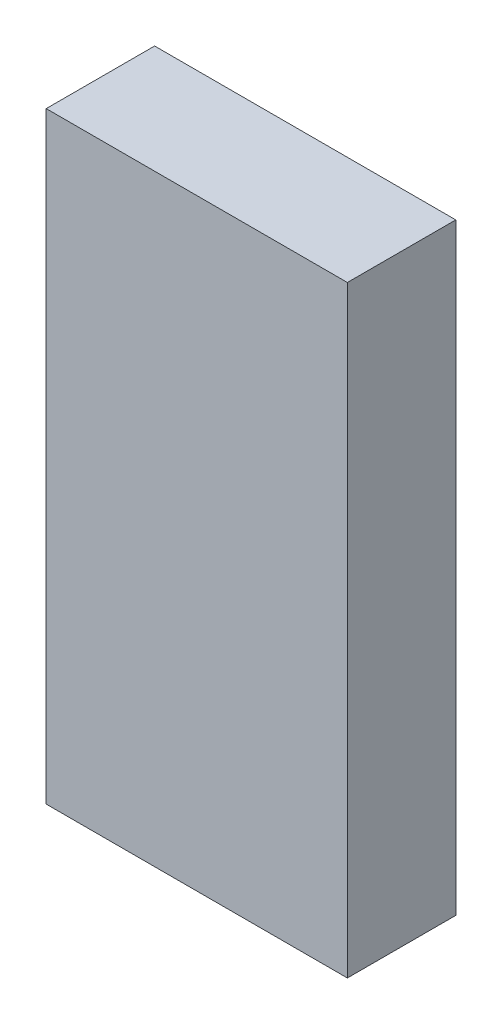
ISO-10303-21;
HEADER;
FILE_DESCRIPTION(('STEP AP214'),'2;1');
FILE_NAME('part.step','',(''),(''),'','','');
FILE_SCHEMA(('AUTOMOTIVE_DESIGN { 1 0 10303 214 1 1 1 1 }'));
ENDSEC;
DATA;
#1=APPLICATION_CONTEXT('core data for automotive mechanical design processes');
#2=APPLICATION_PROTOCOL_DEFINITION('international standard','automotive_design',2000,#1);
#3=PRODUCT_CONTEXT('',#1,'mechanical');
#4=PRODUCT('Part','Part','',(#3));
#5=PRODUCT_RELATED_PRODUCT_CATEGORY('part','',(#4));
#6=PRODUCT_DEFINITION_FORMATION('','',#4);
#7=PRODUCT_DEFINITION_CONTEXT('part definition',#1,'design');
#8=PRODUCT_DEFINITION('design','',#6,#7);
#9=PRODUCT_DEFINITION_SHAPE('','',#8);
#10=(LENGTH_UNIT() NAMED_UNIT(*) SI_UNIT(.MILLI.,.METRE.));
#11=(NAMED_UNIT(*) PLANE_ANGLE_UNIT() SI_UNIT($,.RADIAN.));
#12=(NAMED_UNIT(*) SI_UNIT($,.STERADIAN.) SOLID_ANGLE_UNIT());
#13=UNCERTAINTY_MEASURE_WITH_UNIT(LENGTH_MEASURE(1.E-05),#10,'distance_accuracy_value','');
#14=(GEOMETRIC_REPRESENTATION_CONTEXT(3) GLOBAL_UNCERTAINTY_ASSIGNED_CONTEXT((#13)) GLOBAL_UNIT_ASSIGNED_CONTEXT((#10,
#11,#12)) REPRESENTATION_CONTEXT('',''));
#15=CARTESIAN_POINT('',(0.,0.,0.));
#16=DIRECTION('',(0.,0.,1.));
#17=DIRECTION('',(1.,0.,0.));
#18=AXIS2_PLACEMENT_3D('',#15,#16,#17);
#19=CARTESIAN_POINT('',(50.,100.,36.));
#20=DIRECTION('',(-1.,0.,0.));
#21=DIRECTION('',(0.,-1.,0.));
#22=AXIS2_PLACEMENT_3D('',#19,#20,#21);
#23=PLANE('',#22);
#24=DIRECTION('',(0.,1.,0.));
#25=VECTOR('',#24,1.);
#26=CARTESIAN_POINT('',(50.,100.,0.));
#27=LINE('',#26,#25);
#28=CARTESIAN_POINT('',(50.,-100.,0.));
#29=VERTEX_POINT('',#28);
#30=CARTESIAN_POINT('',(50.,100.,0.));
#31=VERTEX_POINT('',#30);
#32=EDGE_CURVE('E250',#29,#31,#27,.T.);
#33=ORIENTED_EDGE('',*,*,#32,.T.);
#34=DIRECTION('',(0.,0.,-1.));
#35=VECTOR('',#34,1.);
#36=CARTESIAN_POINT('',(50.,100.,36.));
#37=LINE('',#36,#35);
#38=CARTESIAN_POINT('',(50.,100.,36.));
#39=VERTEX_POINT('',#38);
#40=EDGE_CURVE('E274',#39,#31,#37,.T.);
#41=ORIENTED_EDGE('',*,*,#40,.F.);
#42=DIRECTION('',(0.,1.,0.));
#43=VECTOR('',#42,1.);
#44=CARTESIAN_POINT('',(50.,100.,36.));
#45=LINE('',#44,#43);
#46=CARTESIAN_POINT('',(50.,-100.,36.));
#47=VERTEX_POINT('',#46);
#48=EDGE_CURVE('E235',#47,#39,#45,.T.);
#49=ORIENTED_EDGE('',*,*,#48,.F.);
#50=DIRECTION('',(0.,0.,-1.));
#51=VECTOR('',#50,1.);
#52=CARTESIAN_POINT('',(50.,-100.,36.));
#53=LINE('',#52,#51);
#54=EDGE_CURVE('E249',#47,#29,#53,.T.);
#55=ORIENTED_EDGE('',*,*,#54,.T.);
#56=EDGE_LOOP('',(#33,#41,#49,#55));
#57=FACE_BOUND('',#56,.T.);
#58=ADVANCED_FACE('F39',(#57),#23,.F.);
#59=CARTESIAN_POINT('',(-50.,100.,36.));
#60=DIRECTION('',(0.,-1.,0.));
#61=DIRECTION('',(0.,0.,-1.));
#62=AXIS2_PLACEMENT_3D('',#59,#60,#61);
#63=PLANE('',#62);
#64=DIRECTION('',(-1.,0.,0.));
#65=VECTOR('',#64,1.);
#66=CARTESIAN_POINT('',(-50.,100.,0.));
#67=LINE('',#66,#65);
#68=CARTESIAN_POINT('',(-50.,100.,0.));
#69=VERTEX_POINT('',#68);
#70=EDGE_CURVE('E254',#31,#69,#67,.T.);
#71=ORIENTED_EDGE('',*,*,#70,.T.);
#72=DIRECTION('',(0.,0.,-1.));
#73=VECTOR('',#72,1.);
#74=CARTESIAN_POINT('',(-50.,100.,36.));
#75=LINE('',#74,#73);
#76=CARTESIAN_POINT('',(-50.,100.,36.));
#77=VERTEX_POINT('',#76);
#78=EDGE_CURVE('E270',#77,#69,#75,.T.);
#79=ORIENTED_EDGE('',*,*,#78,.F.);
#80=DIRECTION('',(-1.,0.,0.));
#81=VECTOR('',#80,1.);
#82=CARTESIAN_POINT('',(-50.,100.,36.));
#83=LINE('',#82,#81);
#84=EDGE_CURVE('E239',#39,#77,#83,.T.);
#85=ORIENTED_EDGE('',*,*,#84,.F.);
#86=ORIENTED_EDGE('',*,*,#40,.T.);
#87=EDGE_LOOP('',(#71,#79,#85,#86));
#88=FACE_BOUND('',#87,.T.);
#89=ADVANCED_FACE('F444',(#88),#63,.F.);
#90=CARTESIAN_POINT('',(-50.,100.,36.));
#91=DIRECTION('',(1.,0.,0.));
#92=DIRECTION('',(0.,1.,0.));
#93=AXIS2_PLACEMENT_3D('',#90,#91,#92);
#94=PLANE('',#93);
#95=DIRECTION('',(0.,-1.,0.));
#96=VECTOR('',#95,1.);
#97=CARTESIAN_POINT('',(-50.,100.,0.));
#98=LINE('',#97,#96);
#99=CARTESIAN_POINT('',(-50.,-100.,0.));
#100=VERTEX_POINT('',#99);
#101=EDGE_CURVE('E258',#69,#100,#98,.T.);
#102=ORIENTED_EDGE('',*,*,#101,.T.);
#103=DIRECTION('',(0.,0.,-1.));
#104=VECTOR('',#103,1.);
#105=CARTESIAN_POINT('',(-50.,-100.,36.));
#106=LINE('',#105,#104);
#107=CARTESIAN_POINT('',(-50.,-100.,36.));
#108=VERTEX_POINT('',#107);
#109=EDGE_CURVE('E266',#108,#100,#106,.T.);
#110=ORIENTED_EDGE('',*,*,#109,.F.);
#111=DIRECTION('',(0.,-1.,0.));
#112=VECTOR('',#111,1.);
#113=CARTESIAN_POINT('',(-50.,100.,36.));
#114=LINE('',#113,#112);
#115=EDGE_CURVE('E243',#77,#108,#114,.T.);
#116=ORIENTED_EDGE('',*,*,#115,.F.);
#117=ORIENTED_EDGE('',*,*,#78,.T.);
#118=EDGE_LOOP('',(#102,#110,#116,#117));
#119=FACE_BOUND('',#118,.T.);
#120=ADVANCED_FACE('F450',(#119),#94,.F.);
#121=CARTESIAN_POINT('',(-50.,-100.,36.));
#122=DIRECTION('',(0.,1.,0.));
#123=DIRECTION('',(0.,0.,1.));
#124=AXIS2_PLACEMENT_3D('',#121,#122,#123);
#125=PLANE('',#124);
#126=DIRECTION('',(1.,0.,0.));
#127=VECTOR('',#126,1.);
#128=CARTESIAN_POINT('',(-50.,-100.,0.));
#129=LINE('',#128,#127);
#130=EDGE_CURVE('E240',#100,#29,#129,.T.);
#131=ORIENTED_EDGE('',*,*,#130,.T.);
#132=ORIENTED_EDGE('',*,*,#54,.F.);
#133=DIRECTION('',(1.,0.,0.));
#134=VECTOR('',#133,1.);
#135=CARTESIAN_POINT('',(-50.,-100.,36.));
#136=LINE('',#135,#134);
#137=EDGE_CURVE('E246',#108,#47,#136,.T.);
#138=ORIENTED_EDGE('',*,*,#137,.F.);
#139=ORIENTED_EDGE('',*,*,#109,.T.);
#140=EDGE_LOOP('',(#131,#132,#138,#139));
#141=FACE_BOUND('',#140,.T.);
#142=ADVANCED_FACE('F603',(#141),#125,.F.);
#143=CARTESIAN_POINT('',(0.,0.,36.));
#144=DIRECTION('',(0.,0.,1.));
#145=DIRECTION('',(1.,0.,0.));
#146=AXIS2_PLACEMENT_3D('',#143,#144,#145);
#147=PLANE('',#146);
#148=ORIENTED_EDGE('',*,*,#48,.T.);
#149=ORIENTED_EDGE('',*,*,#84,.T.);
#150=ORIENTED_EDGE('',*,*,#115,.T.);
#151=ORIENTED_EDGE('',*,*,#137,.T.);
#152=EDGE_LOOP('',(#148,#149,#150,#151));
#153=FACE_BOUND('',#152,.T.);
#154=ADVANCED_FACE('F600',(#153),#147,.T.);
#155=CARTESIAN_POINT('',(0.,0.,0.));
#156=DIRECTION('',(0.,0.,1.));
#157=DIRECTION('',(1.,0.,0.));
#158=AXIS2_PLACEMENT_3D('',#155,#156,#157);
#159=PLANE('',#158);
#160=DIRECTION('',(1.,0.,0.));
#161=VECTOR('',#160,1.);
#162=CARTESIAN_POINT('',(45.,95.,0.));
#163=LINE('',#162,#161);
#164=CARTESIAN_POINT('',(-45.,95.,0.));
#165=VERTEX_POINT('',#164);
#166=CARTESIAN_POINT('',(45.,95.,0.));
#167=VERTEX_POINT('',#166);
#168=EDGE_CURVE('E200',#165,#167,#163,.T.);
#169=ORIENTED_EDGE('',*,*,#168,.F.);
#170=DIRECTION('',(0.,1.,0.));
#171=VECTOR('',#170,1.);
#172=CARTESIAN_POINT('',(-45.,95.,0.));
#173=LINE('',#172,#171);
#174=CARTESIAN_POINT('',(-45.,-95.,0.));
#175=VERTEX_POINT('',#174);
#176=EDGE_CURVE('E55',#175,#165,#173,.T.);
#177=ORIENTED_EDGE('',*,*,#176,.F.);
#178=DIRECTION('',(-1.,0.,0.));
#179=VECTOR('',#178,1.);
#180=CARTESIAN_POINT('',(45.,-95.,0.));
#181=LINE('',#180,#179);
#182=CARTESIAN_POINT('',(45.,-95.,0.));
#183=VERTEX_POINT('',#182);
#184=EDGE_CURVE('E187',#183,#175,#181,.T.);
#185=ORIENTED_EDGE('',*,*,#184,.F.);
#186=DIRECTION('',(0.,-1.,0.));
#187=VECTOR('',#186,1.);
#188=CARTESIAN_POINT('',(45.,95.,0.));
#189=LINE('',#188,#187);
#190=EDGE_CURVE('E191',#167,#183,#189,.T.);
#191=ORIENTED_EDGE('',*,*,#190,.F.);
#192=EDGE_LOOP('',(#169,#177,#185,#191));
#193=FACE_BOUND('',#192,.T.);
#194=ORIENTED_EDGE('',*,*,#32,.F.);
#195=ORIENTED_EDGE('',*,*,#130,.F.);
#196=ORIENTED_EDGE('',*,*,#101,.F.);
#197=ORIENTED_EDGE('',*,*,#70,.F.);
#198=EDGE_LOOP('',(#194,#195,#196,#197));
#199=FACE_BOUND('',#198,.T.);
#200=ADVANCED_FACE('F566',(#193,#199),#159,.F.);
#201=CARTESIAN_POINT('',(0.,0.,5.));
#202=DIRECTION('',(0.,0.,-1.));
#203=DIRECTION('',(-1.,0.,0.));
#204=AXIS2_PLACEMENT_3D('',#201,#202,#203);
#205=PLANE('',#204);
#206=DIRECTION('',(0.,1.,0.));
#207=VECTOR('',#206,1.);
#208=CARTESIAN_POINT('',(-45.,95.,5.));
#209=LINE('',#208,#207);
#210=CARTESIAN_POINT('',(-45.,-95.,5.));
#211=VERTEX_POINT('',#210);
#212=CARTESIAN_POINT('',(-45.,95.,5.));
#213=VERTEX_POINT('',#212);
#214=EDGE_CURVE('E166',#211,#213,#209,.T.);
#215=ORIENTED_EDGE('',*,*,#214,.T.);
#216=DIRECTION('',(1.,0.,0.));
#217=VECTOR('',#216,1.);
#218=CARTESIAN_POINT('',(45.,95.,5.));
#219=LINE('',#218,#217);
#220=CARTESIAN_POINT('',(45.,95.,5.));
#221=VERTEX_POINT('',#220);
#222=EDGE_CURVE('E176',#213,#221,#219,.T.);
#223=ORIENTED_EDGE('',*,*,#222,.T.);
#224=DIRECTION('',(0.,-1.,0.));
#225=VECTOR('',#224,1.);
#226=CARTESIAN_POINT('',(45.,95.,5.));
#227=LINE('',#226,#225);
#228=CARTESIAN_POINT('',(45.,-95.,5.));
#229=VERTEX_POINT('',#228);
#230=EDGE_CURVE('E182',#221,#229,#227,.T.);
#231=ORIENTED_EDGE('',*,*,#230,.T.);
#232=DIRECTION('',(-1.,0.,0.));
#233=VECTOR('',#232,1.);
#234=CARTESIAN_POINT('',(45.,-95.,5.));
#235=LINE('',#234,#233);
#236=EDGE_CURVE('E173',#229,#211,#235,.T.);
#237=ORIENTED_EDGE('',*,*,#236,.T.);
#238=EDGE_LOOP('',(#215,#223,#231,#237));
#239=FACE_BOUND('',#238,.T.);
#240=CARTESIAN_POINT('',(25.,75.,5.));
#241=DIRECTION('',(0.,0.,-1.));
#242=DIRECTION('',(-1.,0.,0.));
#243=AXIS2_PLACEMENT_3D('',#240,#241,#242);
#244=CIRCLE('',#243,10.);
#245=CARTESIAN_POINT('',(35.,75.,5.));
#246=VERTEX_POINT('',#245);
#247=CARTESIAN_POINT('',(25.,85.,5.));
#248=VERTEX_POINT('',#247);
#249=EDGE_CURVE('E231',#246,#248,#244,.F.);
#250=ORIENTED_EDGE('',*,*,#249,.T.);
#251=DIRECTION('',(-1.,0.,0.));
#252=VECTOR('',#251,1.);
#253=CARTESIAN_POINT('',(35.,85.,5.));
#254=LINE('',#253,#252);
#255=CARTESIAN_POINT('',(-25.,85.,5.));
#256=VERTEX_POINT('',#255);
#257=EDGE_CURVE('E225',#248,#256,#254,.T.);
#258=ORIENTED_EDGE('',*,*,#257,.T.);
#259=CARTESIAN_POINT('',(-25.,75.,5.));
#260=DIRECTION('',(0.,0.,-1.));
#261=DIRECTION('',(-1.,0.,0.));
#262=AXIS2_PLACEMENT_3D('',#259,#260,#261);
#263=CIRCLE('',#262,10.);
#264=CARTESIAN_POINT('',(-35.,75.,5.));
#265=VERTEX_POINT('',#264);
#266=EDGE_CURVE('E222',#256,#265,#263,.F.);
#267=ORIENTED_EDGE('',*,*,#266,.T.);
#268=DIRECTION('',(0.,-1.,0.));
#269=VECTOR('',#268,1.);
#270=CARTESIAN_POINT('',(-35.,85.,5.));
#271=LINE('',#270,#269);
#272=CARTESIAN_POINT('',(-35.,-75.,5.));
#273=VERTEX_POINT('',#272);
#274=EDGE_CURVE('E62',#265,#273,#271,.T.);
#275=ORIENTED_EDGE('',*,*,#274,.T.);
#276=CARTESIAN_POINT('',(-25.,-75.,5.));
#277=DIRECTION('',(0.,0.,-1.));
#278=DIRECTION('',(-1.,0.,0.));
#279=AXIS2_PLACEMENT_3D('',#276,#277,#278);
#280=CIRCLE('',#279,10.);
#281=CARTESIAN_POINT('',(-25.,-85.,5.));
#282=VERTEX_POINT('',#281);
#283=EDGE_CURVE('E11',#273,#282,#280,.F.);
#284=ORIENTED_EDGE('',*,*,#283,.T.);
#285=DIRECTION('',(1.,0.,0.));
#286=VECTOR('',#285,1.);
#287=CARTESIAN_POINT('',(35.,-85.,5.));
#288=LINE('',#287,#286);
#289=CARTESIAN_POINT('',(25.,-85.,5.));
#290=VERTEX_POINT('',#289);
#291=EDGE_CURVE('E209',#282,#290,#288,.T.);
#292=ORIENTED_EDGE('',*,*,#291,.T.);
#293=CARTESIAN_POINT('',(25.,-75.,5.));
#294=DIRECTION('',(0.,0.,-1.));
#295=DIRECTION('',(-1.,0.,0.));
#296=AXIS2_PLACEMENT_3D('',#293,#294,#295);
#297=CIRCLE('',#296,10.);
#298=CARTESIAN_POINT('',(35.,-75.,5.));
#299=VERTEX_POINT('',#298);
#300=EDGE_CURVE('E219',#290,#299,#297,.F.);
#301=ORIENTED_EDGE('',*,*,#300,.T.);
#302=DIRECTION('',(0.,1.,0.));
#303=VECTOR('',#302,1.);
#304=CARTESIAN_POINT('',(35.,85.,5.));
#305=LINE('',#304,#303);
#306=EDGE_CURVE('E228',#299,#246,#305,.T.);
#307=ORIENTED_EDGE('',*,*,#306,.T.);
#308=EDGE_LOOP('',(#250,#258,#267,#275,#284,#292,#301,#307));
#309=FACE_BOUND('',#308,.T.);
#310=ADVANCED_FACE('F184',(#239,#309),#205,.T.);
#311=CARTESIAN_POINT('',(-45.,95.,5.));
#312=DIRECTION('',(-1.,0.,0.));
#313=DIRECTION('',(0.,0.,1.));
#314=AXIS2_PLACEMENT_3D('',#311,#312,#313);
#315=PLANE('',#314);
#316=ORIENTED_EDGE('',*,*,#176,.T.);
#317=DIRECTION('',(0.,0.,-1.));
#318=VECTOR('',#317,1.);
#319=CARTESIAN_POINT('',(-45.,95.,5.));
#320=LINE('',#319,#318);
#321=EDGE_CURVE('E162',#213,#165,#320,.T.);
#322=ORIENTED_EDGE('',*,*,#321,.F.);
#323=ORIENTED_EDGE('',*,*,#214,.F.);
#324=DIRECTION('',(0.,0.,-1.));
#325=VECTOR('',#324,1.);
#326=CARTESIAN_POINT('',(-45.,-95.,5.));
#327=LINE('',#326,#325);
#328=EDGE_CURVE('E206',#211,#175,#327,.T.);
#329=ORIENTED_EDGE('',*,*,#328,.T.);
#330=EDGE_LOOP('',(#316,#322,#323,#329));
#331=FACE_BOUND('',#330,.T.);
#332=ADVANCED_FACE('F164',(#331),#315,.F.);
#333=CARTESIAN_POINT('',(45.,-95.,5.));
#334=DIRECTION('',(0.,-1.,0.));
#335=DIRECTION('',(0.,0.,-1.));
#336=AXIS2_PLACEMENT_3D('',#333,#334,#335);
#337=PLANE('',#336);
#338=ORIENTED_EDGE('',*,*,#184,.T.);
#339=ORIENTED_EDGE('',*,*,#328,.F.);
#340=ORIENTED_EDGE('',*,*,#236,.F.);
#341=DIRECTION('',(0.,0.,-1.));
#342=VECTOR('',#341,1.);
#343=CARTESIAN_POINT('',(45.,-95.,5.));
#344=LINE('',#343,#342);
#345=EDGE_CURVE('E210',#229,#183,#344,.T.);
#346=ORIENTED_EDGE('',*,*,#345,.T.);
#347=EDGE_LOOP('',(#338,#339,#340,#346));
#348=FACE_BOUND('',#347,.T.);
#349=ADVANCED_FACE('F575',(#348),#337,.F.);
#350=CARTESIAN_POINT('',(45.,95.,5.));
#351=DIRECTION('',(1.,0.,0.));
#352=DIRECTION('',(0.,0.,-1.));
#353=AXIS2_PLACEMENT_3D('',#350,#351,#352);
#354=PLANE('',#353);
#355=ORIENTED_EDGE('',*,*,#190,.T.);
#356=ORIENTED_EDGE('',*,*,#345,.F.);
#357=ORIENTED_EDGE('',*,*,#230,.F.);
#358=DIRECTION('',(0.,0.,-1.));
#359=VECTOR('',#358,1.);
#360=CARTESIAN_POINT('',(45.,95.,5.));
#361=LINE('',#360,#359);
#362=EDGE_CURVE('E172',#221,#167,#361,.T.);
#363=ORIENTED_EDGE('',*,*,#362,.T.);
#364=EDGE_LOOP('',(#355,#356,#357,#363));
#365=FACE_BOUND('',#364,.T.);
#366=ADVANCED_FACE('F583',(#365),#354,.F.);
#367=CARTESIAN_POINT('',(45.,95.,5.));
#368=DIRECTION('',(0.,1.,0.));
#369=DIRECTION('',(0.,0.,1.));
#370=AXIS2_PLACEMENT_3D('',#367,#368,#369);
#371=PLANE('',#370);
#372=ORIENTED_EDGE('',*,*,#168,.T.);
#373=ORIENTED_EDGE('',*,*,#362,.F.);
#374=ORIENTED_EDGE('',*,*,#222,.F.);
#375=ORIENTED_EDGE('',*,*,#321,.T.);
#376=EDGE_LOOP('',(#372,#373,#374,#375));
#377=FACE_BOUND('',#376,.T.);
#378=ADVANCED_FACE('F177',(#377),#371,.F.);
#379=CARTESIAN_POINT('',(0.,0.,28.));
#380=DIRECTION('',(0.,0.,-1.));
#381=DIRECTION('',(-1.,0.,0.));
#382=AXIS2_PLACEMENT_3D('',#379,#380,#381);
#383=PLANE('',#382);
#384=DIRECTION('',(0.,-1.,0.));
#385=VECTOR('',#384,1.);
#386=CARTESIAN_POINT('',(25.,0.,28.));
#387=LINE('',#386,#385);
#388=CARTESIAN_POINT('',(25.,75.,28.));
#389=VERTEX_POINT('',#388);
#390=CARTESIAN_POINT('',(25.,-75.,28.));
#391=VERTEX_POINT('',#390);
#392=EDGE_CURVE('E284',#389,#391,#387,.T.);
#393=ORIENTED_EDGE('',*,*,#392,.T.);
#394=DIRECTION('',(-1.,0.,0.));
#395=VECTOR('',#394,1.);
#396=CARTESIAN_POINT('',(0.,-75.,28.));
#397=LINE('',#396,#395);
#398=CARTESIAN_POINT('',(-25.,-75.,28.));
#399=VERTEX_POINT('',#398);
#400=EDGE_CURVE('E287',#391,#399,#397,.T.);
#401=ORIENTED_EDGE('',*,*,#400,.T.);
#402=DIRECTION('',(0.,1.,0.));
#403=VECTOR('',#402,1.);
#404=CARTESIAN_POINT('',(-25.,0.,28.));
#405=LINE('',#404,#403);
#406=CARTESIAN_POINT('',(-25.,75.,28.));
#407=VERTEX_POINT('',#406);
#408=EDGE_CURVE('E278',#399,#407,#405,.T.);
#409=ORIENTED_EDGE('',*,*,#408,.T.);
#410=DIRECTION('',(1.,0.,0.));
#411=VECTOR('',#410,1.);
#412=CARTESIAN_POINT('',(0.,75.,28.));
#413=LINE('',#412,#411);
#414=EDGE_CURVE('E281',#407,#389,#413,.T.);
#415=ORIENTED_EDGE('',*,*,#414,.T.);
#416=EDGE_LOOP('',(#393,#401,#409,#415));
#417=FACE_BOUND('',#416,.T.);
#418=ADVANCED_FACE('F389',(#417),#383,.T.);
#419=CARTESIAN_POINT('',(-25.,0.,18.));
#420=DIRECTION('',(0.,1.,0.));
#421=DIRECTION('',(0.,0.,1.));
#422=AXIS2_PLACEMENT_3D('',#419,#420,#421);
#423=CYLINDRICAL_SURFACE('',#422,10.);
#424=CARTESIAN_POINT('',(-25.,75.,18.));
#425=DIRECTION('',(0.,-1.,0.));
#426=DIRECTION('',(0.,0.,-1.));
#427=AXIS2_PLACEMENT_3D('',#424,#425,#426);
#428=CIRCLE('',#427,10.);
#429=CARTESIAN_POINT('',(-35.,75.,18.));
#430=VERTEX_POINT('',#429);
#431=EDGE_CURVE('E352',#430,#407,#428,.F.);
#432=ORIENTED_EDGE('',*,*,#431,.T.);
#433=ORIENTED_EDGE('',*,*,#408,.F.);
#434=CARTESIAN_POINT('',(-25.,-75.,18.));
#435=DIRECTION('',(0.,1.,0.));
#436=DIRECTION('',(0.,0.,1.));
#437=AXIS2_PLACEMENT_3D('',#434,#435,#436);
#438=CIRCLE('',#437,10.);
#439=CARTESIAN_POINT('',(-35.,-75.,18.));
#440=VERTEX_POINT('',#439);
#441=EDGE_CURVE('E340',#440,#399,#438,.T.);
#442=ORIENTED_EDGE('',*,*,#441,.F.);
#443=DIRECTION('',(0.,1.,0.));
#444=VECTOR('',#443,1.);
#445=CARTESIAN_POINT('',(-35.,85.,18.));
#446=LINE('',#445,#444);
#447=EDGE_CURVE('E325',#430,#440,#446,.F.);
#448=ORIENTED_EDGE('',*,*,#447,.F.);
#449=EDGE_LOOP('',(#432,#433,#442,#448));
#450=FACE_BOUND('',#449,.T.);
#451=ADVANCED_FACE('F418',(#450),#423,.F.);
#452=CARTESIAN_POINT('',(0.,-75.,18.));
#453=DIRECTION('',(-1.,0.,0.));
#454=DIRECTION('',(0.,0.,1.));
#455=AXIS2_PLACEMENT_3D('',#452,#453,#454);
#456=CYLINDRICAL_SURFACE('',#455,10.);
#457=CARTESIAN_POINT('',(25.,-75.,18.));
#458=DIRECTION('',(-1.,0.,0.));
#459=DIRECTION('',(0.,0.,1.));
#460=AXIS2_PLACEMENT_3D('',#457,#458,#459);
#461=CIRCLE('',#460,10.);
#462=CARTESIAN_POINT('',(25.,-85.,18.));
#463=VERTEX_POINT('',#462);
#464=EDGE_CURVE('E333',#391,#463,#461,.F.);
#465=ORIENTED_EDGE('',*,*,#464,.T.);
#466=DIRECTION('',(-1.,0.,0.));
#467=VECTOR('',#466,1.);
#468=CARTESIAN_POINT('',(35.,-85.,18.));
#469=LINE('',#468,#467);
#470=CARTESIAN_POINT('',(-25.,-85.,18.));
#471=VERTEX_POINT('',#470);
#472=EDGE_CURVE('E295',#471,#463,#469,.F.);
#473=ORIENTED_EDGE('',*,*,#472,.F.);
#474=CARTESIAN_POINT('',(-25.,-75.,18.));
#475=DIRECTION('',(1.,0.,0.));
#476=DIRECTION('',(0.,0.,-1.));
#477=AXIS2_PLACEMENT_3D('',#474,#475,#476);
#478=CIRCLE('',#477,10.);
#479=EDGE_CURVE('E234',#471,#399,#478,.F.);
#480=ORIENTED_EDGE('',*,*,#479,.T.);
#481=ORIENTED_EDGE('',*,*,#400,.F.);
#482=EDGE_LOOP('',(#465,#473,#480,#481));
#483=FACE_BOUND('',#482,.T.);
#484=ADVANCED_FACE('F423',(#483),#456,.F.);
#485=CARTESIAN_POINT('',(25.,0.,18.));
#486=DIRECTION('',(0.,-1.,0.));
#487=DIRECTION('',(0.,0.,-1.));
#488=AXIS2_PLACEMENT_3D('',#485,#486,#487);
#489=CYLINDRICAL_SURFACE('',#488,10.);
#490=CARTESIAN_POINT('',(25.,75.,18.));
#491=DIRECTION('',(0.,-1.,0.));
#492=DIRECTION('',(0.,0.,-1.));
#493=AXIS2_PLACEMENT_3D('',#490,#491,#492);
#494=CIRCLE('',#493,10.);
#495=CARTESIAN_POINT('',(35.,75.,18.));
#496=VERTEX_POINT('',#495);
#497=EDGE_CURVE('E356',#389,#496,#494,.F.);
#498=ORIENTED_EDGE('',*,*,#497,.T.);
#499=DIRECTION('',(0.,-1.,0.));
#500=VECTOR('',#499,1.);
#501=CARTESIAN_POINT('',(35.,85.,18.));
#502=LINE('',#501,#500);
#503=CARTESIAN_POINT('',(35.,-75.,18.));
#504=VERTEX_POINT('',#503);
#505=EDGE_CURVE('E306',#504,#496,#502,.F.);
#506=ORIENTED_EDGE('',*,*,#505,.F.);
#507=CARTESIAN_POINT('',(25.,-75.,18.));
#508=DIRECTION('',(0.,1.,0.));
#509=DIRECTION('',(0.,0.,1.));
#510=AXIS2_PLACEMENT_3D('',#507,#508,#509);
#511=CIRCLE('',#510,10.);
#512=EDGE_CURVE('E344',#391,#504,#511,.T.);
#513=ORIENTED_EDGE('',*,*,#512,.F.);
#514=ORIENTED_EDGE('',*,*,#392,.F.);
#515=EDGE_LOOP('',(#498,#506,#513,#514));
#516=FACE_BOUND('',#515,.T.);
#517=ADVANCED_FACE('F384',(#516),#489,.F.);
#518=CARTESIAN_POINT('',(0.,75.,18.));
#519=DIRECTION('',(1.,0.,0.));
#520=DIRECTION('',(0.,0.,-1.));
#521=AXIS2_PLACEMENT_3D('',#518,#519,#520);
#522=CYLINDRICAL_SURFACE('',#521,10.);
#523=CARTESIAN_POINT('',(-25.,75.,18.));
#524=DIRECTION('',(1.,0.,0.));
#525=DIRECTION('',(0.,0.,-1.));
#526=AXIS2_PLACEMENT_3D('',#523,#524,#525);
#527=CIRCLE('',#526,10.);
#528=CARTESIAN_POINT('',(-25.,85.,18.));
#529=VERTEX_POINT('',#528);
#530=EDGE_CURVE('E364',#529,#407,#527,.T.);
#531=ORIENTED_EDGE('',*,*,#530,.F.);
#532=DIRECTION('',(1.,0.,0.));
#533=VECTOR('',#532,1.);
#534=CARTESIAN_POINT('',(35.,85.,18.));
#535=LINE('',#534,#533);
#536=CARTESIAN_POINT('',(25.,85.,18.));
#537=VERTEX_POINT('',#536);
#538=EDGE_CURVE('E315',#537,#529,#535,.F.);
#539=ORIENTED_EDGE('',*,*,#538,.F.);
#540=CARTESIAN_POINT('',(25.,75.,18.));
#541=DIRECTION('',(-1.,0.,0.));
#542=DIRECTION('',(0.,0.,1.));
#543=AXIS2_PLACEMENT_3D('',#540,#541,#542);
#544=CIRCLE('',#543,10.);
#545=EDGE_CURVE('E368',#389,#537,#544,.T.);
#546=ORIENTED_EDGE('',*,*,#545,.F.);
#547=ORIENTED_EDGE('',*,*,#414,.F.);
#548=EDGE_LOOP('',(#531,#539,#546,#547));
#549=FACE_BOUND('',#548,.T.);
#550=ADVANCED_FACE('F396',(#549),#522,.F.);
#551=CARTESIAN_POINT('',(25.,75.,18.));
#552=DIRECTION('',(0.,0.,1.));
#553=DIRECTION('',(1.,0.,0.));
#554=AXIS2_PLACEMENT_3D('',#551,#552,#553);
#555=SPHERICAL_SURFACE('',#554,10.);
#556=ORIENTED_EDGE('',*,*,#545,.T.);
#557=CARTESIAN_POINT('',(25.,75.,18.));
#558=DIRECTION('',(0.,0.,-1.));
#559=DIRECTION('',(-1.,0.,0.));
#560=AXIS2_PLACEMENT_3D('',#557,#558,#559);
#561=CIRCLE('',#560,10.);
#562=EDGE_CURVE('E255',#537,#496,#561,.T.);
#563=ORIENTED_EDGE('',*,*,#562,.T.);
#564=ORIENTED_EDGE('',*,*,#497,.F.);
#565=EDGE_LOOP('',(#556,#563,#564));
#566=FACE_BOUND('',#565,.T.);
#567=ADVANCED_FACE('F376',(#566),#555,.F.);
#568=CARTESIAN_POINT('',(-25.,75.,18.));
#569=DIRECTION('',(0.,0.,1.));
#570=DIRECTION('',(1.,0.,0.));
#571=AXIS2_PLACEMENT_3D('',#568,#569,#570);
#572=SPHERICAL_SURFACE('',#571,10.);
#573=CARTESIAN_POINT('',(-25.,75.,18.));
#574=DIRECTION('',(0.,0.,-1.));
#575=DIRECTION('',(-1.,0.,0.));
#576=AXIS2_PLACEMENT_3D('',#573,#574,#575);
#577=CIRCLE('',#576,10.);
#578=EDGE_CURVE('E360',#430,#529,#577,.T.);
#579=ORIENTED_EDGE('',*,*,#578,.T.);
#580=ORIENTED_EDGE('',*,*,#530,.T.);
#581=ORIENTED_EDGE('',*,*,#431,.F.);
#582=EDGE_LOOP('',(#579,#580,#581));
#583=FACE_BOUND('',#582,.T.);
#584=ADVANCED_FACE('F462',(#583),#572,.F.);
#585=CARTESIAN_POINT('',(25.,-75.,18.));
#586=DIRECTION('',(0.,0.,1.));
#587=DIRECTION('',(1.,0.,0.));
#588=AXIS2_PLACEMENT_3D('',#585,#586,#587);
#589=SPHERICAL_SURFACE('',#588,10.);
#590=ORIENTED_EDGE('',*,*,#512,.T.);
#591=CARTESIAN_POINT('',(25.,-75.,18.));
#592=DIRECTION('',(0.,0.,-1.));
#593=DIRECTION('',(-1.,0.,0.));
#594=AXIS2_PLACEMENT_3D('',#591,#592,#593);
#595=CIRCLE('',#594,10.);
#596=EDGE_CURVE('E348',#504,#463,#595,.T.);
#597=ORIENTED_EDGE('',*,*,#596,.T.);
#598=ORIENTED_EDGE('',*,*,#464,.F.);
#599=EDGE_LOOP('',(#590,#597,#598));
#600=FACE_BOUND('',#599,.T.);
#601=ADVANCED_FACE('F459',(#600),#589,.F.);
#602=CARTESIAN_POINT('',(-25.,-75.,18.));
#603=DIRECTION('',(0.,0.,1.));
#604=DIRECTION('',(1.,0.,0.));
#605=AXIS2_PLACEMENT_3D('',#602,#603,#604);
#606=SPHERICAL_SURFACE('',#605,10.);
#607=CARTESIAN_POINT('',(-25.,-75.,18.));
#608=DIRECTION('',(0.,0.,-1.));
#609=DIRECTION('',(-1.,0.,0.));
#610=AXIS2_PLACEMENT_3D('',#607,#608,#609);
#611=CIRCLE('',#610,10.);
#612=EDGE_CURVE('E336',#471,#440,#611,.T.);
#613=ORIENTED_EDGE('',*,*,#612,.T.);
#614=ORIENTED_EDGE('',*,*,#441,.T.);
#615=ORIENTED_EDGE('',*,*,#479,.F.);
#616=EDGE_LOOP('',(#613,#614,#615));
#617=FACE_BOUND('',#616,.T.);
#618=ADVANCED_FACE('F421',(#617),#606,.F.);
#619=CARTESIAN_POINT('',(-25.,75.,28.));
#620=DIRECTION('',(0.,0.,1.));
#621=DIRECTION('',(1.,0.,0.));
#622=AXIS2_PLACEMENT_3D('',#619,#620,#621);
#623=CYLINDRICAL_SURFACE('',#622,10.);
#624=ORIENTED_EDGE('',*,*,#266,.F.);
#625=DIRECTION('',(0.,0.,-1.));
#626=VECTOR('',#625,1.);
#627=CARTESIAN_POINT('',(-25.,85.,0.));
#628=LINE('',#627,#626);
#629=EDGE_CURVE('E318',#529,#256,#628,.T.);
#630=ORIENTED_EDGE('',*,*,#629,.F.);
#631=ORIENTED_EDGE('',*,*,#578,.F.);
#632=DIRECTION('',(0.,0.,-1.));
#633=VECTOR('',#632,1.);
#634=CARTESIAN_POINT('',(-35.,75.,28.));
#635=LINE('',#634,#633);
#636=EDGE_CURVE('E322',#265,#430,#635,.F.);
#637=ORIENTED_EDGE('',*,*,#636,.F.);
#638=EDGE_LOOP('',(#624,#630,#631,#637));
#639=FACE_BOUND('',#638,.T.);
#640=ADVANCED_FACE('F404',(#639),#623,.F.);
#641=CARTESIAN_POINT('',(25.,75.,28.));
#642=DIRECTION('',(0.,0.,1.));
#643=DIRECTION('',(1.,0.,0.));
#644=AXIS2_PLACEMENT_3D('',#641,#642,#643);
#645=CYLINDRICAL_SURFACE('',#644,10.);
#646=ORIENTED_EDGE('',*,*,#249,.F.);
#647=DIRECTION('',(0.,0.,-1.));
#648=VECTOR('',#647,1.);
#649=CARTESIAN_POINT('',(35.,75.,0.));
#650=LINE('',#649,#648);
#651=EDGE_CURVE('E302',#496,#246,#650,.T.);
#652=ORIENTED_EDGE('',*,*,#651,.F.);
#653=ORIENTED_EDGE('',*,*,#562,.F.);
#654=DIRECTION('',(0.,0.,-1.));
#655=VECTOR('',#654,1.);
#656=CARTESIAN_POINT('',(25.,85.,28.));
#657=LINE('',#656,#655);
#658=EDGE_CURVE('E312',#248,#537,#657,.F.);
#659=ORIENTED_EDGE('',*,*,#658,.F.);
#660=EDGE_LOOP('',(#646,#652,#653,#659));
#661=FACE_BOUND('',#660,.T.);
#662=ADVANCED_FACE('F41',(#661),#645,.F.);
#663=CARTESIAN_POINT('',(35.,85.,28.));
#664=DIRECTION('',(0.,1.,0.));
#665=DIRECTION('',(0.,0.,1.));
#666=AXIS2_PLACEMENT_3D('',#663,#664,#665);
#667=PLANE('',#666);
#668=ORIENTED_EDGE('',*,*,#257,.F.);
#669=ORIENTED_EDGE('',*,*,#658,.T.);
#670=ORIENTED_EDGE('',*,*,#538,.T.);
#671=ORIENTED_EDGE('',*,*,#629,.T.);
#672=EDGE_LOOP('',(#668,#669,#670,#671));
#673=FACE_BOUND('',#672,.T.);
#674=ADVANCED_FACE('F400',(#673),#667,.F.);
#675=CARTESIAN_POINT('',(25.,-75.,28.));
#676=DIRECTION('',(0.,0.,1.));
#677=DIRECTION('',(1.,0.,0.));
#678=AXIS2_PLACEMENT_3D('',#675,#676,#677);
#679=CYLINDRICAL_SURFACE('',#678,10.);
#680=ORIENTED_EDGE('',*,*,#300,.F.);
#681=DIRECTION('',(0.,0.,-1.));
#682=VECTOR('',#681,1.);
#683=CARTESIAN_POINT('',(25.,-85.,0.));
#684=LINE('',#683,#682);
#685=EDGE_CURVE('E291',#463,#290,#684,.T.);
#686=ORIENTED_EDGE('',*,*,#685,.F.);
#687=ORIENTED_EDGE('',*,*,#596,.F.);
#688=DIRECTION('',(0.,0.,-1.));
#689=VECTOR('',#688,1.);
#690=CARTESIAN_POINT('',(35.,-75.,28.));
#691=LINE('',#690,#689);
#692=EDGE_CURVE('E309',#299,#504,#691,.F.);
#693=ORIENTED_EDGE('',*,*,#692,.F.);
#694=EDGE_LOOP('',(#680,#686,#687,#693));
#695=FACE_BOUND('',#694,.T.);
#696=ADVANCED_FACE('F432',(#695),#679,.F.);
#697=CARTESIAN_POINT('',(35.,85.,28.));
#698=DIRECTION('',(1.,0.,0.));
#699=DIRECTION('',(0.,0.,-1.));
#700=AXIS2_PLACEMENT_3D('',#697,#698,#699);
#701=PLANE('',#700);
#702=ORIENTED_EDGE('',*,*,#306,.F.);
#703=ORIENTED_EDGE('',*,*,#692,.T.);
#704=ORIENTED_EDGE('',*,*,#505,.T.);
#705=ORIENTED_EDGE('',*,*,#651,.T.);
#706=EDGE_LOOP('',(#702,#703,#704,#705));
#707=FACE_BOUND('',#706,.T.);
#708=ADVANCED_FACE('F434',(#707),#701,.F.);
#709=CARTESIAN_POINT('',(-25.,-75.,28.));
#710=DIRECTION('',(0.,0.,1.));
#711=DIRECTION('',(1.,0.,0.));
#712=AXIS2_PLACEMENT_3D('',#709,#710,#711);
#713=CYLINDRICAL_SURFACE('',#712,10.);
#714=ORIENTED_EDGE('',*,*,#283,.F.);
#715=DIRECTION('',(0.,0.,-1.));
#716=VECTOR('',#715,1.);
#717=CARTESIAN_POINT('',(-35.,-75.,0.));
#718=LINE('',#717,#716);
#719=EDGE_CURVE('E48',#440,#273,#718,.T.);
#720=ORIENTED_EDGE('',*,*,#719,.F.);
#721=ORIENTED_EDGE('',*,*,#612,.F.);
#722=DIRECTION('',(0.,0.,-1.));
#723=VECTOR('',#722,1.);
#724=CARTESIAN_POINT('',(-25.,-85.,28.));
#725=LINE('',#724,#723);
#726=EDGE_CURVE('E299',#282,#471,#725,.F.);
#727=ORIENTED_EDGE('',*,*,#726,.F.);
#728=EDGE_LOOP('',(#714,#720,#721,#727));
#729=FACE_BOUND('',#728,.T.);
#730=ADVANCED_FACE('F414',(#729),#713,.F.);
#731=CARTESIAN_POINT('',(35.,-85.,28.));
#732=DIRECTION('',(0.,-1.,0.));
#733=DIRECTION('',(0.,0.,-1.));
#734=AXIS2_PLACEMENT_3D('',#731,#732,#733);
#735=PLANE('',#734);
#736=ORIENTED_EDGE('',*,*,#291,.F.);
#737=ORIENTED_EDGE('',*,*,#726,.T.);
#738=ORIENTED_EDGE('',*,*,#472,.T.);
#739=ORIENTED_EDGE('',*,*,#685,.T.);
#740=EDGE_LOOP('',(#736,#737,#738,#739));
#741=FACE_BOUND('',#740,.T.);
#742=ADVANCED_FACE('F426',(#741),#735,.F.);
#743=CARTESIAN_POINT('',(-35.,85.,28.));
#744=DIRECTION('',(-1.,0.,0.));
#745=DIRECTION('',(0.,0.,1.));
#746=AXIS2_PLACEMENT_3D('',#743,#744,#745);
#747=PLANE('',#746);
#748=ORIENTED_EDGE('',*,*,#274,.F.);
#749=ORIENTED_EDGE('',*,*,#636,.T.);
#750=ORIENTED_EDGE('',*,*,#447,.T.);
#751=ORIENTED_EDGE('',*,*,#719,.T.);
#752=EDGE_LOOP('',(#748,#749,#750,#751));
#753=FACE_BOUND('',#752,.T.);
#754=ADVANCED_FACE('F408',(#753),#747,.F.);
#755=CLOSED_SHELL('',(#58,#89,#120,#142,#154,#200,#310,#332,#349,#366,#378,#418,#451,#484,#517,
#550,#567,#584,#601,#618,#640,#662,#674,#696,#708,#730,#742,#754));
#756=MANIFOLD_SOLID_BREP('B2',#755);
#757=ADVANCED_BREP_SHAPE_REPRESENTATION('',(#18,#756),#14);
#758=SHAPE_DEFINITION_REPRESENTATION(#9,#757);
ENDSEC;
END-ISO-10303-21;
